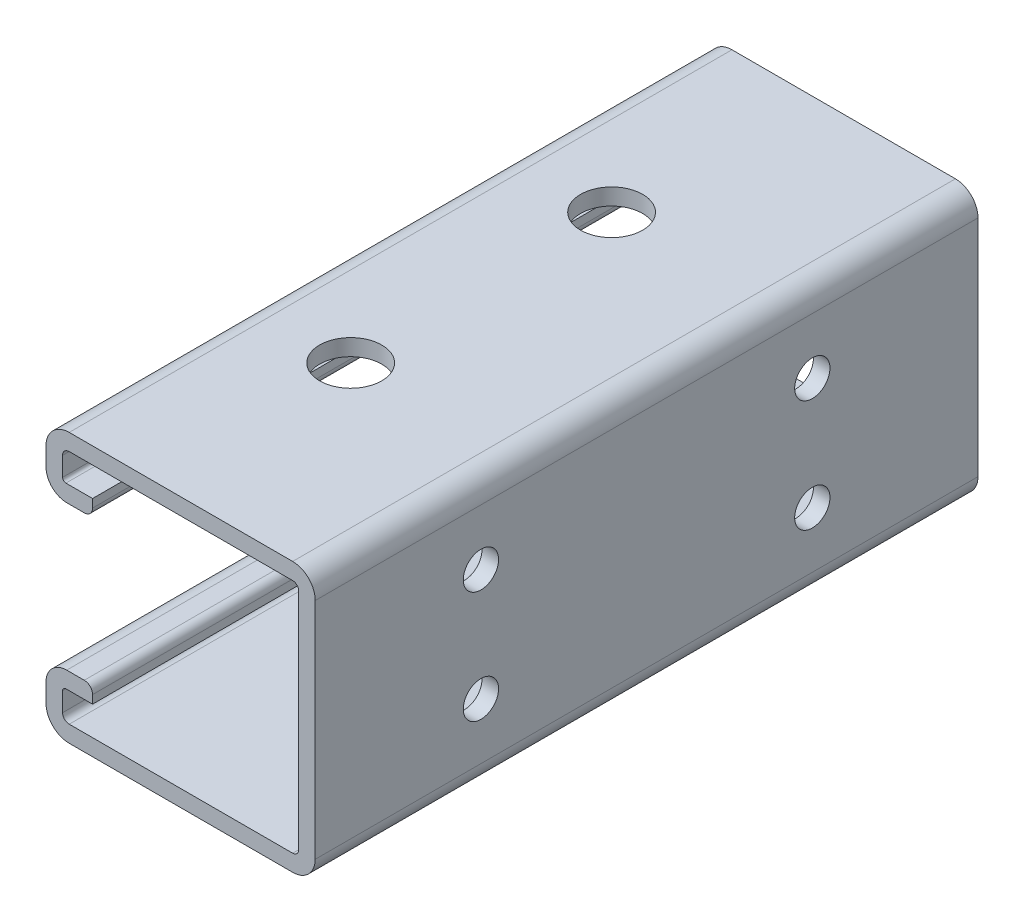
ISO-10303-21;
HEADER;
FILE_DESCRIPTION(('STEP AP214'),'2;1');
FILE_NAME('part.step','',(''),(''),'','','');
FILE_SCHEMA(('AUTOMOTIVE_DESIGN { 1 0 10303 214 1 1 1 1 }'));
ENDSEC;
DATA;
#1=APPLICATION_CONTEXT('core data for automotive mechanical design processes');
#2=APPLICATION_PROTOCOL_DEFINITION('international standard','automotive_design',2000,#1);
#3=PRODUCT_CONTEXT('',#1,'mechanical');
#4=PRODUCT('Part','Part','',(#3));
#5=PRODUCT_RELATED_PRODUCT_CATEGORY('part','',(#4));
#6=PRODUCT_DEFINITION_FORMATION('','',#4);
#7=PRODUCT_DEFINITION_CONTEXT('part definition',#1,'design');
#8=PRODUCT_DEFINITION('design','',#6,#7);
#9=PRODUCT_DEFINITION_SHAPE('','',#8);
#10=(LENGTH_UNIT() NAMED_UNIT(*) SI_UNIT(.MILLI.,.METRE.));
#11=(NAMED_UNIT(*) PLANE_ANGLE_UNIT() SI_UNIT($,.RADIAN.));
#12=(NAMED_UNIT(*) SI_UNIT($,.STERADIAN.) SOLID_ANGLE_UNIT());
#13=UNCERTAINTY_MEASURE_WITH_UNIT(LENGTH_MEASURE(1.E-05),#10,'distance_accuracy_value','');
#14=(GEOMETRIC_REPRESENTATION_CONTEXT(3) GLOBAL_UNCERTAINTY_ASSIGNED_CONTEXT((#13)) GLOBAL_UNIT_ASSIGNED_CONTEXT((#10,
#11,#12)) REPRESENTATION_CONTEXT('',''));
#15=CARTESIAN_POINT('',(0.,0.,0.));
#16=DIRECTION('',(0.,0.,1.));
#17=DIRECTION('',(1.,0.,0.));
#18=AXIS2_PLACEMENT_3D('',#15,#16,#17);
#19=CARTESIAN_POINT('',(18.0975,17.17675,-50.8));
#20=DIRECTION('',(-1.,0.,0.));
#21=DIRECTION('',(0.,0.,1.));
#22=AXIS2_PLACEMENT_3D('',#19,#20,#21);
#23=PLANE('',#22);
#24=CARTESIAN_POINT('',(18.0975,-8.588375,-25.4));
#25=DIRECTION('',(-1.,0.,0.));
#26=DIRECTION('',(0.,0.,1.));
#27=AXIS2_PLACEMENT_3D('',#24,#25,#26);
#28=CIRCLE('',#27,2.70509999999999);
#29=CARTESIAN_POINT('',(18.0975,-8.588375,-22.6949));
#30=VERTEX_POINT('',#29);
#31=EDGE_CURVE('E872',#30,#30,#28,.F.);
#32=ORIENTED_EDGE('',*,*,#31,.T.);
#33=EDGE_LOOP('',(#32));
#34=FACE_BOUND('',#33,.T.);
#35=CARTESIAN_POINT('',(18.0975,-8.588375,25.4));
#36=DIRECTION('',(-1.,0.,0.));
#37=DIRECTION('',(0.,0.,1.));
#38=AXIS2_PLACEMENT_3D('',#35,#36,#37);
#39=CIRCLE('',#38,2.70509999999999);
#40=CARTESIAN_POINT('',(18.0975,-8.588375,28.1051));
#41=VERTEX_POINT('',#40);
#42=EDGE_CURVE('E877',#41,#41,#39,.F.);
#43=ORIENTED_EDGE('',*,*,#42,.T.);
#44=EDGE_LOOP('',(#43));
#45=FACE_BOUND('',#44,.T.);
#46=CARTESIAN_POINT('',(18.0975,8.588375,25.4));
#47=DIRECTION('',(-1.,0.,0.));
#48=DIRECTION('',(0.,0.,1.));
#49=AXIS2_PLACEMENT_3D('',#46,#47,#48);
#50=CIRCLE('',#49,2.70509999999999);
#51=CARTESIAN_POINT('',(18.0975,8.588375,28.1051));
#52=VERTEX_POINT('',#51);
#53=EDGE_CURVE('E595',#52,#52,#50,.F.);
#54=ORIENTED_EDGE('',*,*,#53,.T.);
#55=EDGE_LOOP('',(#54));
#56=FACE_BOUND('',#55,.T.);
#57=DIRECTION('',(0.,0.,1.));
#58=VECTOR('',#57,1.);
#59=CARTESIAN_POINT('',(18.0975,-17.17675,-50.8));
#60=LINE('',#59,#58);
#61=CARTESIAN_POINT('',(18.0975,-17.17675,-50.8));
#62=VERTEX_POINT('',#61);
#63=CARTESIAN_POINT('',(18.0975,-17.17675,50.8));
#64=VERTEX_POINT('',#63);
#65=EDGE_CURVE('E524',#62,#64,#60,.T.);
#66=ORIENTED_EDGE('',*,*,#65,.T.);
#67=DIRECTION('',(0.,-1.,0.));
#68=VECTOR('',#67,1.);
#69=CARTESIAN_POINT('',(18.0975,17.17675,50.8));
#70=LINE('',#69,#68);
#71=CARTESIAN_POINT('',(18.0975,17.17675,50.8));
#72=VERTEX_POINT('',#71);
#73=EDGE_CURVE('E336',#72,#64,#70,.T.);
#74=ORIENTED_EDGE('',*,*,#73,.F.);
#75=DIRECTION('',(0.,0.,1.));
#76=VECTOR('',#75,1.);
#77=CARTESIAN_POINT('',(18.0975,17.17675,-50.8));
#78=LINE('',#77,#76);
#79=CARTESIAN_POINT('',(18.0975,17.17675,-50.8));
#80=VERTEX_POINT('',#79);
#81=EDGE_CURVE('E527',#80,#72,#78,.T.);
#82=ORIENTED_EDGE('',*,*,#81,.F.);
#83=DIRECTION('',(0.,-1.,0.));
#84=VECTOR('',#83,1.);
#85=CARTESIAN_POINT('',(18.0975,17.17675,-50.8));
#86=LINE('',#85,#84);
#87=EDGE_CURVE('E450',#80,#62,#86,.T.);
#88=ORIENTED_EDGE('',*,*,#87,.T.);
#89=EDGE_LOOP('',(#66,#74,#82,#88));
#90=FACE_BOUND('',#89,.T.);
#91=CARTESIAN_POINT('',(18.0975,8.588375,-25.4));
#92=DIRECTION('',(-1.,0.,0.));
#93=DIRECTION('',(0.,0.,1.));
#94=AXIS2_PLACEMENT_3D('',#91,#92,#93);
#95=CIRCLE('',#94,2.70509999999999);
#96=CARTESIAN_POINT('',(18.0975,8.588375,-22.6949));
#97=VERTEX_POINT('',#96);
#98=EDGE_CURVE('E864',#97,#97,#95,.F.);
#99=ORIENTED_EDGE('',*,*,#98,.T.);
#100=EDGE_LOOP('',(#99));
#101=FACE_BOUND('',#100,.T.);
#102=ADVANCED_FACE('F44',(#34,#45,#56,#90,#101),#23,.T.);
#103=CARTESIAN_POINT('',(-17.0815,-17.0815,-50.8));
#104=DIRECTION('',(0.,0.,1.));
#105=DIRECTION('',(1.,0.,0.));
#106=AXIS2_PLACEMENT_3D('',#103,#104,#105);
#107=CYLINDRICAL_SURFACE('',#106,3.556);
#108=DIRECTION('',(0.,0.,1.));
#109=VECTOR('',#108,1.);
#110=CARTESIAN_POINT('',(-17.0815,-20.6375,-50.8));
#111=LINE('',#110,#109);
#112=CARTESIAN_POINT('',(-17.0815,-20.6375,-50.8));
#113=VERTEX_POINT('',#112);
#114=CARTESIAN_POINT('',(-17.0815,-20.6375,50.8));
#115=VERTEX_POINT('',#114);
#116=EDGE_CURVE('E240',#113,#115,#111,.T.);
#117=ORIENTED_EDGE('',*,*,#116,.T.);
#118=CARTESIAN_POINT('',(-17.0815,-17.0815,50.8));
#119=DIRECTION('',(0.,0.,1.));
#120=DIRECTION('',(1.,0.,0.));
#121=AXIS2_PLACEMENT_3D('',#118,#119,#120);
#122=CIRCLE('',#121,3.556);
#123=CARTESIAN_POINT('',(-20.6375,-17.0815,50.8));
#124=VERTEX_POINT('',#123);
#125=EDGE_CURVE('E243',#124,#115,#122,.T.);
#126=ORIENTED_EDGE('',*,*,#125,.F.);
#127=DIRECTION('',(0.,0.,1.));
#128=VECTOR('',#127,1.);
#129=CARTESIAN_POINT('',(-20.6375,-17.0815,-50.8));
#130=LINE('',#129,#128);
#131=CARTESIAN_POINT('',(-20.6375,-17.0815,-50.8));
#132=VERTEX_POINT('',#131);
#133=EDGE_CURVE('E11',#132,#124,#130,.T.);
#134=ORIENTED_EDGE('',*,*,#133,.F.);
#135=CARTESIAN_POINT('',(-17.0815,-17.0815,-50.8));
#136=DIRECTION('',(0.,0.,1.));
#137=DIRECTION('',(1.,0.,0.));
#138=AXIS2_PLACEMENT_3D('',#135,#136,#137);
#139=CIRCLE('',#138,3.556);
#140=EDGE_CURVE('E244',#132,#113,#139,.T.);
#141=ORIENTED_EDGE('',*,*,#140,.T.);
#142=EDGE_LOOP('',(#117,#126,#134,#141));
#143=FACE_BOUND('',#142,.T.);
#144=ADVANCED_FACE('F46',(#143),#107,.T.);
#145=CARTESIAN_POINT('',(-20.6375,-14.2875,-50.8));
#146=DIRECTION('',(-1.,0.,0.));
#147=DIRECTION('',(0.,-1.,0.));
#148=AXIS2_PLACEMENT_3D('',#145,#146,#147);
#149=PLANE('',#148);
#150=ORIENTED_EDGE('',*,*,#133,.T.);
#151=DIRECTION('',(0.,-1.,0.));
#152=VECTOR('',#151,1.);
#153=CARTESIAN_POINT('',(-20.6375,-14.2875,50.8));
#154=LINE('',#153,#152);
#155=CARTESIAN_POINT('',(-20.6375,-14.2875,50.8));
#156=VERTEX_POINT('',#155);
#157=EDGE_CURVE('E264',#156,#124,#154,.T.);
#158=ORIENTED_EDGE('',*,*,#157,.F.);
#159=DIRECTION('',(0.,0.,1.));
#160=VECTOR('',#159,1.);
#161=CARTESIAN_POINT('',(-20.6375,-14.2875,-50.8));
#162=LINE('',#161,#160);
#163=CARTESIAN_POINT('',(-20.6375,-14.2875,-50.8));
#164=VERTEX_POINT('',#163);
#165=EDGE_CURVE('E54',#164,#156,#162,.T.);
#166=ORIENTED_EDGE('',*,*,#165,.F.);
#167=DIRECTION('',(0.,-1.,0.));
#168=VECTOR('',#167,1.);
#169=CARTESIAN_POINT('',(-20.6375,-14.2875,-50.8));
#170=LINE('',#169,#168);
#171=EDGE_CURVE('E250',#164,#132,#170,.T.);
#172=ORIENTED_EDGE('',*,*,#171,.T.);
#173=EDGE_LOOP('',(#150,#158,#166,#172));
#174=FACE_BOUND('',#173,.T.);
#175=ADVANCED_FACE('F635',(#174),#149,.T.);
#176=CARTESIAN_POINT('',(-17.4625,-14.2875,-50.8));
#177=DIRECTION('',(0.,0.,1.));
#178=DIRECTION('',(1.,0.,0.));
#179=AXIS2_PLACEMENT_3D('',#176,#177,#178);
#180=CYLINDRICAL_SURFACE('',#179,3.175);
#181=ORIENTED_EDGE('',*,*,#165,.T.);
#182=CARTESIAN_POINT('',(-17.4625,-14.2875,50.8));
#183=DIRECTION('',(0.,0.,1.));
#184=DIRECTION('',(1.,0.,0.));
#185=AXIS2_PLACEMENT_3D('',#182,#183,#184);
#186=CIRCLE('',#185,3.175);
#187=CARTESIAN_POINT('',(-17.4625,-11.1125,50.8));
#188=VERTEX_POINT('',#187);
#189=EDGE_CURVE('E376',#188,#156,#186,.T.);
#190=ORIENTED_EDGE('',*,*,#189,.F.);
#191=DIRECTION('',(0.,0.,1.));
#192=VECTOR('',#191,1.);
#193=CARTESIAN_POINT('',(-17.4625,-11.1125,-50.8));
#194=LINE('',#193,#192);
#195=CARTESIAN_POINT('',(-17.4625,-11.1125,-50.8));
#196=VERTEX_POINT('',#195);
#197=EDGE_CURVE('E497',#196,#188,#194,.T.);
#198=ORIENTED_EDGE('',*,*,#197,.F.);
#199=CARTESIAN_POINT('',(-17.4625,-14.2875,-50.8));
#200=DIRECTION('',(0.,0.,1.));
#201=DIRECTION('',(1.,0.,0.));
#202=AXIS2_PLACEMENT_3D('',#199,#200,#201);
#203=CIRCLE('',#202,3.175);
#204=EDGE_CURVE('E490',#196,#164,#203,.T.);
#205=ORIENTED_EDGE('',*,*,#204,.T.);
#206=EDGE_LOOP('',(#181,#190,#198,#205));
#207=FACE_BOUND('',#206,.T.);
#208=ADVANCED_FACE('F792',(#207),#180,.T.);
#209=CARTESIAN_POINT('',(-14.7701,-11.1125,-50.8));
#210=DIRECTION('',(0.,1.,0.));
#211=DIRECTION('',(0.,0.,1.));
#212=AXIS2_PLACEMENT_3D('',#209,#210,#211);
#213=PLANE('',#212);
#214=ORIENTED_EDGE('',*,*,#197,.T.);
#215=DIRECTION('',(-1.,0.,0.));
#216=VECTOR('',#215,1.);
#217=CARTESIAN_POINT('',(-14.7701,-11.1125,50.8));
#218=LINE('',#217,#216);
#219=CARTESIAN_POINT('',(-14.7701,-11.1125,50.8));
#220=VERTEX_POINT('',#219);
#221=EDGE_CURVE('E372',#220,#188,#218,.T.);
#222=ORIENTED_EDGE('',*,*,#221,.F.);
#223=DIRECTION('',(0.,0.,1.));
#224=VECTOR('',#223,1.);
#225=CARTESIAN_POINT('',(-14.7701,-11.1125,-50.8));
#226=LINE('',#225,#224);
#227=CARTESIAN_POINT('',(-14.7701,-11.1125,-50.8));
#228=VERTEX_POINT('',#227);
#229=EDGE_CURVE('E500',#228,#220,#226,.T.);
#230=ORIENTED_EDGE('',*,*,#229,.F.);
#231=DIRECTION('',(-1.,0.,0.));
#232=VECTOR('',#231,1.);
#233=CARTESIAN_POINT('',(-14.7701,-11.1125,-50.8));
#234=LINE('',#233,#232);
#235=EDGE_CURVE('E486',#228,#196,#234,.T.);
#236=ORIENTED_EDGE('',*,*,#235,.T.);
#237=EDGE_LOOP('',(#214,#222,#230,#236));
#238=FACE_BOUND('',#237,.T.);
#239=ADVANCED_FACE('F788',(#238),#213,.T.);
#240=CARTESIAN_POINT('',(-14.7701,-12.3825,-50.8));
#241=DIRECTION('',(0.,0.,1.));
#242=DIRECTION('',(1.,0.,0.));
#243=AXIS2_PLACEMENT_3D('',#240,#241,#242);
#244=CYLINDRICAL_SURFACE('',#243,1.27);
#245=ORIENTED_EDGE('',*,*,#229,.T.);
#246=CARTESIAN_POINT('',(-14.7701,-12.3825,50.8));
#247=DIRECTION('',(0.,0.,1.));
#248=DIRECTION('',(1.,0.,0.));
#249=AXIS2_PLACEMENT_3D('',#246,#247,#248);
#250=CIRCLE('',#249,1.27);
#251=CARTESIAN_POINT('',(-13.5001,-12.3825,50.8));
#252=VERTEX_POINT('',#251);
#253=EDGE_CURVE('E368',#252,#220,#250,.T.);
#254=ORIENTED_EDGE('',*,*,#253,.F.);
#255=DIRECTION('',(0.,0.,1.));
#256=VECTOR('',#255,1.);
#257=CARTESIAN_POINT('',(-13.5001,-12.3825,-50.8));
#258=LINE('',#257,#256);
#259=CARTESIAN_POINT('',(-13.5001,-12.3825,-50.8));
#260=VERTEX_POINT('',#259);
#261=EDGE_CURVE('E503',#260,#252,#258,.T.);
#262=ORIENTED_EDGE('',*,*,#261,.F.);
#263=CARTESIAN_POINT('',(-14.7701,-12.3825,-50.8));
#264=DIRECTION('',(0.,0.,1.));
#265=DIRECTION('',(1.,0.,0.));
#266=AXIS2_PLACEMENT_3D('',#263,#264,#265);
#267=CIRCLE('',#266,1.27);
#268=EDGE_CURVE('E482',#260,#228,#267,.T.);
#269=ORIENTED_EDGE('',*,*,#268,.T.);
#270=EDGE_LOOP('',(#245,#254,#262,#269));
#271=FACE_BOUND('',#270,.T.);
#272=ADVANCED_FACE('F783',(#271),#244,.T.);
#273=CARTESIAN_POINT('',(-13.5001,-13.6525,-50.8));
#274=DIRECTION('',(1.,0.,0.));
#275=DIRECTION('',(0.,0.,-1.));
#276=AXIS2_PLACEMENT_3D('',#273,#274,#275);
#277=PLANE('',#276);
#278=ORIENTED_EDGE('',*,*,#261,.T.);
#279=DIRECTION('',(0.,1.,0.));
#280=VECTOR('',#279,1.);
#281=CARTESIAN_POINT('',(-13.5001,-13.6525,50.8));
#282=LINE('',#281,#280);
#283=CARTESIAN_POINT('',(-13.5001,-13.6525,50.8));
#284=VERTEX_POINT('',#283);
#285=EDGE_CURVE('E364',#284,#252,#282,.T.);
#286=ORIENTED_EDGE('',*,*,#285,.F.);
#287=DIRECTION('',(0.,0.,1.));
#288=VECTOR('',#287,1.);
#289=CARTESIAN_POINT('',(-13.5001,-13.6525,-50.8));
#290=LINE('',#289,#288);
#291=CARTESIAN_POINT('',(-13.5001,-13.6525,-50.8));
#292=VERTEX_POINT('',#291);
#293=EDGE_CURVE('E506',#292,#284,#290,.T.);
#294=ORIENTED_EDGE('',*,*,#293,.F.);
#295=DIRECTION('',(0.,1.,0.));
#296=VECTOR('',#295,1.);
#297=CARTESIAN_POINT('',(-13.5001,-13.6525,-50.8));
#298=LINE('',#297,#296);
#299=EDGE_CURVE('E478',#292,#260,#298,.T.);
#300=ORIENTED_EDGE('',*,*,#299,.T.);
#301=EDGE_LOOP('',(#278,#286,#294,#300));
#302=FACE_BOUND('',#301,.T.);
#303=ADVANCED_FACE('F781',(#302),#277,.T.);
#304=CARTESIAN_POINT('',(-17.5895,-13.6525,-50.8));
#305=DIRECTION('',(0.,-1.,0.));
#306=DIRECTION('',(1.,0.,0.));
#307=AXIS2_PLACEMENT_3D('',#304,#305,#306);
#308=PLANE('',#307);
#309=ORIENTED_EDGE('',*,*,#293,.T.);
#310=DIRECTION('',(1.,0.,0.));
#311=VECTOR('',#310,1.);
#312=CARTESIAN_POINT('',(-17.5895,-13.6525,50.8));
#313=LINE('',#312,#311);
#314=CARTESIAN_POINT('',(-17.5895,-13.6525,50.8));
#315=VERTEX_POINT('',#314);
#316=EDGE_CURVE('E360',#315,#284,#313,.T.);
#317=ORIENTED_EDGE('',*,*,#316,.F.);
#318=DIRECTION('',(0.,0.,1.));
#319=VECTOR('',#318,1.);
#320=CARTESIAN_POINT('',(-17.5895,-13.6525,-50.8));
#321=LINE('',#320,#319);
#322=CARTESIAN_POINT('',(-17.5895,-13.6525,-50.8));
#323=VERTEX_POINT('',#322);
#324=EDGE_CURVE('E509',#323,#315,#321,.T.);
#325=ORIENTED_EDGE('',*,*,#324,.F.);
#326=DIRECTION('',(1.,0.,0.));
#327=VECTOR('',#326,1.);
#328=CARTESIAN_POINT('',(-17.5895,-13.6525,-50.8));
#329=LINE('',#328,#327);
#330=EDGE_CURVE('E474',#323,#292,#329,.T.);
#331=ORIENTED_EDGE('',*,*,#330,.T.);
#332=EDGE_LOOP('',(#309,#317,#325,#331));
#333=FACE_BOUND('',#332,.T.);
#334=ADVANCED_FACE('F776',(#333),#308,.T.);
#335=CARTESIAN_POINT('',(-17.5895,-14.1605,-50.8));
#336=DIRECTION('',(0.,0.,1.));
#337=DIRECTION('',(1.,0.,0.));
#338=AXIS2_PLACEMENT_3D('',#335,#336,#337);
#339=CYLINDRICAL_SURFACE('',#338,0.507999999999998);
#340=ORIENTED_EDGE('',*,*,#324,.T.);
#341=CARTESIAN_POINT('',(-17.5895,-14.1605,50.8));
#342=DIRECTION('',(0.,0.,-1.));
#343=DIRECTION('',(1.,0.,0.));
#344=AXIS2_PLACEMENT_3D('',#341,#342,#343);
#345=CIRCLE('',#344,0.507999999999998);
#346=CARTESIAN_POINT('',(-18.0975,-14.1605,50.8));
#347=VERTEX_POINT('',#346);
#348=EDGE_CURVE('E356',#347,#315,#345,.T.);
#349=ORIENTED_EDGE('',*,*,#348,.F.);
#350=DIRECTION('',(0.,0.,1.));
#351=VECTOR('',#350,1.);
#352=CARTESIAN_POINT('',(-18.0975,-14.1605,-50.8));
#353=LINE('',#352,#351);
#354=CARTESIAN_POINT('',(-18.0975,-14.1605,-50.8));
#355=VERTEX_POINT('',#354);
#356=EDGE_CURVE('E512',#355,#347,#353,.T.);
#357=ORIENTED_EDGE('',*,*,#356,.F.);
#358=CARTESIAN_POINT('',(-17.5895,-14.1605,-50.8));
#359=DIRECTION('',(0.,0.,-1.));
#360=DIRECTION('',(1.,0.,0.));
#361=AXIS2_PLACEMENT_3D('',#358,#359,#360);
#362=CIRCLE('',#361,0.507999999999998);
#363=EDGE_CURVE('E470',#355,#323,#362,.T.);
#364=ORIENTED_EDGE('',*,*,#363,.T.);
#365=EDGE_LOOP('',(#340,#349,#357,#364));
#366=FACE_BOUND('',#365,.T.);
#367=ADVANCED_FACE('F771',(#366),#339,.F.);
#368=CARTESIAN_POINT('',(-18.0975,-17.0815,-50.8));
#369=DIRECTION('',(1.,0.,0.));
#370=DIRECTION('',(0.,1.,0.));
#371=AXIS2_PLACEMENT_3D('',#368,#369,#370);
#372=PLANE('',#371);
#373=ORIENTED_EDGE('',*,*,#356,.T.);
#374=DIRECTION('',(0.,1.,0.));
#375=VECTOR('',#374,1.);
#376=CARTESIAN_POINT('',(-18.0975,-17.0815,50.8));
#377=LINE('',#376,#375);
#378=CARTESIAN_POINT('',(-18.0975,-17.0815,50.8));
#379=VERTEX_POINT('',#378);
#380=EDGE_CURVE('E352',#379,#347,#377,.T.);
#381=ORIENTED_EDGE('',*,*,#380,.F.);
#382=DIRECTION('',(0.,0.,1.));
#383=VECTOR('',#382,1.);
#384=CARTESIAN_POINT('',(-18.0975,-17.0815,-50.8));
#385=LINE('',#384,#383);
#386=CARTESIAN_POINT('',(-18.0975,-17.0815,-50.8));
#387=VERTEX_POINT('',#386);
#388=EDGE_CURVE('E515',#387,#379,#385,.T.);
#389=ORIENTED_EDGE('',*,*,#388,.F.);
#390=DIRECTION('',(0.,1.,0.));
#391=VECTOR('',#390,1.);
#392=CARTESIAN_POINT('',(-18.0975,-17.0815,-50.8));
#393=LINE('',#392,#391);
#394=EDGE_CURVE('E466',#387,#355,#393,.T.);
#395=ORIENTED_EDGE('',*,*,#394,.T.);
#396=EDGE_LOOP('',(#373,#381,#389,#395));
#397=FACE_BOUND('',#396,.T.);
#398=ADVANCED_FACE('F769',(#397),#372,.T.);
#399=CARTESIAN_POINT('',(-17.0815,-17.0815,-50.8));
#400=DIRECTION('',(0.,0.,1.));
#401=DIRECTION('',(1.,0.,0.));
#402=AXIS2_PLACEMENT_3D('',#399,#400,#401);
#403=CYLINDRICAL_SURFACE('',#402,1.016);
#404=ORIENTED_EDGE('',*,*,#388,.T.);
#405=CARTESIAN_POINT('',(-17.0815,-17.0815,50.8));
#406=DIRECTION('',(0.,0.,-1.));
#407=DIRECTION('',(1.,0.,0.));
#408=AXIS2_PLACEMENT_3D('',#405,#406,#407);
#409=CIRCLE('',#408,1.016);
#410=CARTESIAN_POINT('',(-17.0815,-18.0975,50.8));
#411=VERTEX_POINT('',#410);
#412=EDGE_CURVE('E348',#411,#379,#409,.T.);
#413=ORIENTED_EDGE('',*,*,#412,.F.);
#414=DIRECTION('',(0.,0.,1.));
#415=VECTOR('',#414,1.);
#416=CARTESIAN_POINT('',(-17.0815,-18.0975,-50.8));
#417=LINE('',#416,#415);
#418=CARTESIAN_POINT('',(-17.0815,-18.0975,-50.8));
#419=VERTEX_POINT('',#418);
#420=EDGE_CURVE('E518',#419,#411,#417,.T.);
#421=ORIENTED_EDGE('',*,*,#420,.F.);
#422=CARTESIAN_POINT('',(-17.0815,-17.0815,-50.8));
#423=DIRECTION('',(0.,0.,-1.));
#424=DIRECTION('',(1.,0.,0.));
#425=AXIS2_PLACEMENT_3D('',#422,#423,#424);
#426=CIRCLE('',#425,1.016);
#427=EDGE_CURVE('E462',#419,#387,#426,.T.);
#428=ORIENTED_EDGE('',*,*,#427,.T.);
#429=EDGE_LOOP('',(#404,#413,#421,#428));
#430=FACE_BOUND('',#429,.T.);
#431=ADVANCED_FACE('F764',(#430),#403,.F.);
#432=CARTESIAN_POINT('',(17.17675,-18.0975,-50.8));
#433=DIRECTION('',(0.,1.,0.));
#434=DIRECTION('',(-1.,0.,0.));
#435=AXIS2_PLACEMENT_3D('',#432,#433,#434);
#436=PLANE('',#435);
#437=CARTESIAN_POINT('',(-4.73074999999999,-18.0975,20.));
#438=DIRECTION('',(0.,1.,0.));
#439=DIRECTION('',(-1.,0.,0.));
#440=AXIS2_PLACEMENT_3D('',#437,#438,#439);
#441=CIRCLE('',#440,4.7625);
#442=CARTESIAN_POINT('',(-9.49324999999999,-18.0975,20.));
#443=VERTEX_POINT('',#442);
#444=EDGE_CURVE('E266',#443,#443,#441,.T.);
#445=ORIENTED_EDGE('',*,*,#444,.F.);
#446=EDGE_LOOP('',(#445));
#447=FACE_BOUND('',#446,.T.);
#448=CARTESIAN_POINT('',(-4.73075,-18.0975,-20.));
#449=DIRECTION('',(0.,1.,0.));
#450=DIRECTION('',(-1.,0.,0.));
#451=AXIS2_PLACEMENT_3D('',#448,#449,#450);
#452=CIRCLE('',#451,4.7625);
#453=CARTESIAN_POINT('',(-9.49325,-18.0975,-20.));
#454=VERTEX_POINT('',#453);
#455=EDGE_CURVE('E586',#454,#454,#452,.T.);
#456=ORIENTED_EDGE('',*,*,#455,.F.);
#457=EDGE_LOOP('',(#456));
#458=FACE_BOUND('',#457,.T.);
#459=ORIENTED_EDGE('',*,*,#420,.T.);
#460=DIRECTION('',(-1.,0.,0.));
#461=VECTOR('',#460,1.);
#462=CARTESIAN_POINT('',(17.17675,-18.0975,50.8));
#463=LINE('',#462,#461);
#464=CARTESIAN_POINT('',(17.17675,-18.0975,50.8));
#465=VERTEX_POINT('',#464);
#466=EDGE_CURVE('E344',#465,#411,#463,.T.);
#467=ORIENTED_EDGE('',*,*,#466,.F.);
#468=DIRECTION('',(0.,0.,1.));
#469=VECTOR('',#468,1.);
#470=CARTESIAN_POINT('',(17.17675,-18.0975,-50.8));
#471=LINE('',#470,#469);
#472=CARTESIAN_POINT('',(17.17675,-18.0975,-50.8));
#473=VERTEX_POINT('',#472);
#474=EDGE_CURVE('E521',#473,#465,#471,.T.);
#475=ORIENTED_EDGE('',*,*,#474,.F.);
#476=DIRECTION('',(-1.,0.,0.));
#477=VECTOR('',#476,1.);
#478=CARTESIAN_POINT('',(17.17675,-18.0975,-50.8));
#479=LINE('',#478,#477);
#480=EDGE_CURVE('E458',#473,#419,#479,.T.);
#481=ORIENTED_EDGE('',*,*,#480,.T.);
#482=EDGE_LOOP('',(#459,#467,#475,#481));
#483=FACE_BOUND('',#482,.T.);
#484=ADVANCED_FACE('F759',(#447,#458,#483),#436,.T.);
#485=CARTESIAN_POINT('',(17.17675,-17.17675,-50.8));
#486=DIRECTION('',(0.,0.,1.));
#487=DIRECTION('',(1.,0.,0.));
#488=AXIS2_PLACEMENT_3D('',#485,#486,#487);
#489=CYLINDRICAL_SURFACE('',#488,0.920750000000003);
#490=ORIENTED_EDGE('',*,*,#474,.T.);
#491=CARTESIAN_POINT('',(17.17675,-17.17675,50.8));
#492=DIRECTION('',(0.,0.,-1.));
#493=DIRECTION('',(1.,0.,0.));
#494=AXIS2_PLACEMENT_3D('',#491,#492,#493);
#495=CIRCLE('',#494,0.920750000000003);
#496=EDGE_CURVE('E340',#64,#465,#495,.T.);
#497=ORIENTED_EDGE('',*,*,#496,.F.);
#498=ORIENTED_EDGE('',*,*,#65,.F.);
#499=CARTESIAN_POINT('',(17.17675,-17.17675,-50.8));
#500=DIRECTION('',(0.,0.,-1.));
#501=DIRECTION('',(1.,0.,0.));
#502=AXIS2_PLACEMENT_3D('',#499,#500,#501);
#503=CIRCLE('',#502,0.920750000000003);
#504=EDGE_CURVE('E454',#62,#473,#503,.T.);
#505=ORIENTED_EDGE('',*,*,#504,.T.);
#506=EDGE_LOOP('',(#490,#497,#498,#505));
#507=FACE_BOUND('',#506,.T.);
#508=ADVANCED_FACE('F640',(#507),#489,.F.);
#509=CARTESIAN_POINT('',(17.17675,17.17675,-50.8));
#510=DIRECTION('',(0.,0.,1.));
#511=DIRECTION('',(1.,0.,0.));
#512=AXIS2_PLACEMENT_3D('',#509,#510,#511);
#513=CYLINDRICAL_SURFACE('',#512,0.920750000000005);
#514=ORIENTED_EDGE('',*,*,#81,.T.);
#515=CARTESIAN_POINT('',(17.17675,17.17675,50.8));
#516=DIRECTION('',(0.,0.,-1.));
#517=DIRECTION('',(1.,0.,0.));
#518=AXIS2_PLACEMENT_3D('',#515,#516,#517);
#519=CIRCLE('',#518,0.920750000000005);
#520=CARTESIAN_POINT('',(17.17675,18.0975,50.8));
#521=VERTEX_POINT('',#520);
#522=EDGE_CURVE('E332',#521,#72,#519,.T.);
#523=ORIENTED_EDGE('',*,*,#522,.F.);
#524=DIRECTION('',(0.,0.,1.));
#525=VECTOR('',#524,1.);
#526=CARTESIAN_POINT('',(17.17675,18.0975,-50.8));
#527=LINE('',#526,#525);
#528=CARTESIAN_POINT('',(17.17675,18.0975,-50.8));
#529=VERTEX_POINT('',#528);
#530=EDGE_CURVE('E530',#529,#521,#527,.T.);
#531=ORIENTED_EDGE('',*,*,#530,.F.);
#532=CARTESIAN_POINT('',(17.17675,17.17675,-50.8));
#533=DIRECTION('',(0.,0.,-1.));
#534=DIRECTION('',(1.,0.,0.));
#535=AXIS2_PLACEMENT_3D('',#532,#533,#534);
#536=CIRCLE('',#535,0.920750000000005);
#537=EDGE_CURVE('E446',#529,#80,#536,.T.);
#538=ORIENTED_EDGE('',*,*,#537,.T.);
#539=EDGE_LOOP('',(#514,#523,#531,#538));
#540=FACE_BOUND('',#539,.T.);
#541=ADVANCED_FACE('F642',(#540),#513,.F.);
#542=CARTESIAN_POINT('',(-17.0815,18.0975,-50.8));
#543=DIRECTION('',(0.,-1.,0.));
#544=DIRECTION('',(1.,0.,0.));
#545=AXIS2_PLACEMENT_3D('',#542,#543,#544);
#546=PLANE('',#545);
#547=CARTESIAN_POINT('',(-4.73075,18.0975,20.));
#548=DIRECTION('',(0.,-1.,0.));
#549=DIRECTION('',(1.,0.,0.));
#550=AXIS2_PLACEMENT_3D('',#547,#548,#549);
#551=CIRCLE('',#550,4.7625);
#552=CARTESIAN_POINT('',(0.0317500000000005,18.0975,20.));
#553=VERTEX_POINT('',#552);
#554=EDGE_CURVE('E270',#553,#553,#551,.T.);
#555=ORIENTED_EDGE('',*,*,#554,.F.);
#556=EDGE_LOOP('',(#555));
#557=FACE_BOUND('',#556,.T.);
#558=CARTESIAN_POINT('',(-4.73075,18.0975,-20.));
#559=DIRECTION('',(0.,-1.,0.));
#560=DIRECTION('',(1.,0.,0.));
#561=AXIS2_PLACEMENT_3D('',#558,#559,#560);
#562=CIRCLE('',#561,4.7625);
#563=CARTESIAN_POINT('',(0.0317499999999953,18.0975,-20.));
#564=VERTEX_POINT('',#563);
#565=EDGE_CURVE('E579',#564,#564,#562,.T.);
#566=ORIENTED_EDGE('',*,*,#565,.F.);
#567=EDGE_LOOP('',(#566));
#568=FACE_BOUND('',#567,.T.);
#569=ORIENTED_EDGE('',*,*,#530,.T.);
#570=DIRECTION('',(1.,0.,0.));
#571=VECTOR('',#570,1.);
#572=CARTESIAN_POINT('',(-17.0815,18.0975,50.8));
#573=LINE('',#572,#571);
#574=CARTESIAN_POINT('',(-17.0815,18.0975,50.8));
#575=VERTEX_POINT('',#574);
#576=EDGE_CURVE('E328',#575,#521,#573,.T.);
#577=ORIENTED_EDGE('',*,*,#576,.F.);
#578=DIRECTION('',(0.,0.,1.));
#579=VECTOR('',#578,1.);
#580=CARTESIAN_POINT('',(-17.0815,18.0975,-50.8));
#581=LINE('',#580,#579);
#582=CARTESIAN_POINT('',(-17.0815,18.0975,-50.8));
#583=VERTEX_POINT('',#582);
#584=EDGE_CURVE('E533',#583,#575,#581,.T.);
#585=ORIENTED_EDGE('',*,*,#584,.F.);
#586=DIRECTION('',(1.,0.,0.));
#587=VECTOR('',#586,1.);
#588=CARTESIAN_POINT('',(-17.0815,18.0975,-50.8));
#589=LINE('',#588,#587);
#590=EDGE_CURVE('E442',#583,#529,#589,.T.);
#591=ORIENTED_EDGE('',*,*,#590,.T.);
#592=EDGE_LOOP('',(#569,#577,#585,#591));
#593=FACE_BOUND('',#592,.T.);
#594=ADVANCED_FACE('F645',(#557,#568,#593),#546,.T.);
#595=CARTESIAN_POINT('',(-17.0815,17.0815,-50.8));
#596=DIRECTION('',(0.,0.,1.));
#597=DIRECTION('',(1.,0.,0.));
#598=AXIS2_PLACEMENT_3D('',#595,#596,#597);
#599=CYLINDRICAL_SURFACE('',#598,1.016);
#600=ORIENTED_EDGE('',*,*,#584,.T.);
#601=CARTESIAN_POINT('',(-17.0815,17.0815,50.8));
#602=DIRECTION('',(0.,0.,-1.));
#603=DIRECTION('',(1.,0.,0.));
#604=AXIS2_PLACEMENT_3D('',#601,#602,#603);
#605=CIRCLE('',#604,1.016);
#606=CARTESIAN_POINT('',(-18.0975,17.0815,50.8));
#607=VERTEX_POINT('',#606);
#608=EDGE_CURVE('E324',#607,#575,#605,.T.);
#609=ORIENTED_EDGE('',*,*,#608,.F.);
#610=DIRECTION('',(0.,0.,1.));
#611=VECTOR('',#610,1.);
#612=CARTESIAN_POINT('',(-18.0975,17.0815,-50.8));
#613=LINE('',#612,#611);
#614=CARTESIAN_POINT('',(-18.0975,17.0815,-50.8));
#615=VERTEX_POINT('',#614);
#616=EDGE_CURVE('E536',#615,#607,#613,.T.);
#617=ORIENTED_EDGE('',*,*,#616,.F.);
#618=CARTESIAN_POINT('',(-17.0815,17.0815,-50.8));
#619=DIRECTION('',(0.,0.,-1.));
#620=DIRECTION('',(1.,0.,0.));
#621=AXIS2_PLACEMENT_3D('',#618,#619,#620);
#622=CIRCLE('',#621,1.016);
#623=EDGE_CURVE('E438',#615,#583,#622,.T.);
#624=ORIENTED_EDGE('',*,*,#623,.T.);
#625=EDGE_LOOP('',(#600,#609,#617,#624));
#626=FACE_BOUND('',#625,.T.);
#627=ADVANCED_FACE('F649',(#626),#599,.F.);
#628=CARTESIAN_POINT('',(-18.0975,14.1605,-50.8));
#629=DIRECTION('',(1.,0.,0.));
#630=DIRECTION('',(0.,1.,0.));
#631=AXIS2_PLACEMENT_3D('',#628,#629,#630);
#632=PLANE('',#631);
#633=ORIENTED_EDGE('',*,*,#616,.T.);
#634=DIRECTION('',(0.,1.,0.));
#635=VECTOR('',#634,1.);
#636=CARTESIAN_POINT('',(-18.0975,14.1605,50.8));
#637=LINE('',#636,#635);
#638=CARTESIAN_POINT('',(-18.0975,14.1605,50.8));
#639=VERTEX_POINT('',#638);
#640=EDGE_CURVE('E320',#639,#607,#637,.T.);
#641=ORIENTED_EDGE('',*,*,#640,.F.);
#642=DIRECTION('',(0.,0.,1.));
#643=VECTOR('',#642,1.);
#644=CARTESIAN_POINT('',(-18.0975,14.1605,-50.8));
#645=LINE('',#644,#643);
#646=CARTESIAN_POINT('',(-18.0975,14.1605,-50.8));
#647=VERTEX_POINT('',#646);
#648=EDGE_CURVE('E539',#647,#639,#645,.T.);
#649=ORIENTED_EDGE('',*,*,#648,.F.);
#650=DIRECTION('',(0.,1.,0.));
#651=VECTOR('',#650,1.);
#652=CARTESIAN_POINT('',(-18.0975,14.1605,-50.8));
#653=LINE('',#652,#651);
#654=EDGE_CURVE('E434',#647,#615,#653,.T.);
#655=ORIENTED_EDGE('',*,*,#654,.T.);
#656=EDGE_LOOP('',(#633,#641,#649,#655));
#657=FACE_BOUND('',#656,.T.);
#658=ADVANCED_FACE('F653',(#657),#632,.T.);
#659=CARTESIAN_POINT('',(-17.5895,14.1605,-50.8));
#660=DIRECTION('',(0.,0.,1.));
#661=DIRECTION('',(1.,0.,0.));
#662=AXIS2_PLACEMENT_3D('',#659,#660,#661);
#663=CYLINDRICAL_SURFACE('',#662,0.507999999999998);
#664=ORIENTED_EDGE('',*,*,#648,.T.);
#665=CARTESIAN_POINT('',(-17.5895,14.1605,50.8));
#666=DIRECTION('',(0.,0.,-1.));
#667=DIRECTION('',(1.,0.,0.));
#668=AXIS2_PLACEMENT_3D('',#665,#666,#667);
#669=CIRCLE('',#668,0.507999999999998);
#670=CARTESIAN_POINT('',(-17.5895,13.6525,50.8));
#671=VERTEX_POINT('',#670);
#672=EDGE_CURVE('E316',#671,#639,#669,.T.);
#673=ORIENTED_EDGE('',*,*,#672,.F.);
#674=DIRECTION('',(0.,0.,1.));
#675=VECTOR('',#674,1.);
#676=CARTESIAN_POINT('',(-17.5895,13.6525,-50.8));
#677=LINE('',#676,#675);
#678=CARTESIAN_POINT('',(-17.5895,13.6525,-50.8));
#679=VERTEX_POINT('',#678);
#680=EDGE_CURVE('E542',#679,#671,#677,.T.);
#681=ORIENTED_EDGE('',*,*,#680,.F.);
#682=CARTESIAN_POINT('',(-17.5895,14.1605,-50.8));
#683=DIRECTION('',(0.,0.,-1.));
#684=DIRECTION('',(1.,0.,0.));
#685=AXIS2_PLACEMENT_3D('',#682,#683,#684);
#686=CIRCLE('',#685,0.507999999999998);
#687=EDGE_CURVE('E430',#679,#647,#686,.T.);
#688=ORIENTED_EDGE('',*,*,#687,.T.);
#689=EDGE_LOOP('',(#664,#673,#681,#688));
#690=FACE_BOUND('',#689,.T.);
#691=ADVANCED_FACE('F657',(#690),#663,.F.);
#692=CARTESIAN_POINT('',(-13.5001,13.6525,-50.8));
#693=DIRECTION('',(0.,1.,0.));
#694=DIRECTION('',(-1.,0.,0.));
#695=AXIS2_PLACEMENT_3D('',#692,#693,#694);
#696=PLANE('',#695);
#697=ORIENTED_EDGE('',*,*,#680,.T.);
#698=DIRECTION('',(-1.,0.,0.));
#699=VECTOR('',#698,1.);
#700=CARTESIAN_POINT('',(-13.5001,13.6525,50.8));
#701=LINE('',#700,#699);
#702=CARTESIAN_POINT('',(-13.5001,13.6525,50.8));
#703=VERTEX_POINT('',#702);
#704=EDGE_CURVE('E312',#703,#671,#701,.T.);
#705=ORIENTED_EDGE('',*,*,#704,.F.);
#706=DIRECTION('',(0.,0.,1.));
#707=VECTOR('',#706,1.);
#708=CARTESIAN_POINT('',(-13.5001,13.6525,-50.8));
#709=LINE('',#708,#707);
#710=CARTESIAN_POINT('',(-13.5001,13.6525,-50.8));
#711=VERTEX_POINT('',#710);
#712=EDGE_CURVE('E545',#711,#703,#709,.T.);
#713=ORIENTED_EDGE('',*,*,#712,.F.);
#714=DIRECTION('',(-1.,0.,0.));
#715=VECTOR('',#714,1.);
#716=CARTESIAN_POINT('',(-13.5001,13.6525,-50.8));
#717=LINE('',#716,#715);
#718=EDGE_CURVE('E426',#711,#679,#717,.T.);
#719=ORIENTED_EDGE('',*,*,#718,.T.);
#720=EDGE_LOOP('',(#697,#705,#713,#719));
#721=FACE_BOUND('',#720,.T.);
#722=ADVANCED_FACE('F661',(#721),#696,.T.);
#723=CARTESIAN_POINT('',(-13.5001,12.3825,-50.8));
#724=DIRECTION('',(1.,0.,0.));
#725=DIRECTION('',(0.,0.,-1.));
#726=AXIS2_PLACEMENT_3D('',#723,#724,#725);
#727=PLANE('',#726);
#728=ORIENTED_EDGE('',*,*,#712,.T.);
#729=DIRECTION('',(0.,1.,0.));
#730=VECTOR('',#729,1.);
#731=CARTESIAN_POINT('',(-13.5001,12.3825,50.8));
#732=LINE('',#731,#730);
#733=CARTESIAN_POINT('',(-13.5001,12.3825,50.8));
#734=VERTEX_POINT('',#733);
#735=EDGE_CURVE('E308',#734,#703,#732,.T.);
#736=ORIENTED_EDGE('',*,*,#735,.F.);
#737=DIRECTION('',(0.,0.,1.));
#738=VECTOR('',#737,1.);
#739=CARTESIAN_POINT('',(-13.5001,12.3825,-50.8));
#740=LINE('',#739,#738);
#741=CARTESIAN_POINT('',(-13.5001,12.3825,-50.8));
#742=VERTEX_POINT('',#741);
#743=EDGE_CURVE('E548',#742,#734,#740,.T.);
#744=ORIENTED_EDGE('',*,*,#743,.F.);
#745=DIRECTION('',(0.,1.,0.));
#746=VECTOR('',#745,1.);
#747=CARTESIAN_POINT('',(-13.5001,12.3825,-50.8));
#748=LINE('',#747,#746);
#749=EDGE_CURVE('E422',#742,#711,#748,.T.);
#750=ORIENTED_EDGE('',*,*,#749,.T.);
#751=EDGE_LOOP('',(#728,#736,#744,#750));
#752=FACE_BOUND('',#751,.T.);
#753=ADVANCED_FACE('F665',(#752),#727,.T.);
#754=CARTESIAN_POINT('',(-14.7701,12.3825,-50.8));
#755=DIRECTION('',(0.,0.,1.));
#756=DIRECTION('',(1.,0.,0.));
#757=AXIS2_PLACEMENT_3D('',#754,#755,#756);
#758=CYLINDRICAL_SURFACE('',#757,1.27);
#759=ORIENTED_EDGE('',*,*,#743,.T.);
#760=CARTESIAN_POINT('',(-14.7701,12.3825,50.8));
#761=DIRECTION('',(0.,0.,1.));
#762=DIRECTION('',(1.,0.,0.));
#763=AXIS2_PLACEMENT_3D('',#760,#761,#762);
#764=CIRCLE('',#763,1.27);
#765=CARTESIAN_POINT('',(-14.7701,11.1125,50.8));
#766=VERTEX_POINT('',#765);
#767=EDGE_CURVE('E304',#766,#734,#764,.T.);
#768=ORIENTED_EDGE('',*,*,#767,.F.);
#769=DIRECTION('',(0.,0.,1.));
#770=VECTOR('',#769,1.);
#771=CARTESIAN_POINT('',(-14.7701,11.1125,-50.8));
#772=LINE('',#771,#770);
#773=CARTESIAN_POINT('',(-14.7701,11.1125,-50.8));
#774=VERTEX_POINT('',#773);
#775=EDGE_CURVE('E551',#774,#766,#772,.T.);
#776=ORIENTED_EDGE('',*,*,#775,.F.);
#777=CARTESIAN_POINT('',(-14.7701,12.3825,-50.8));
#778=DIRECTION('',(0.,0.,1.));
#779=DIRECTION('',(1.,0.,0.));
#780=AXIS2_PLACEMENT_3D('',#777,#778,#779);
#781=CIRCLE('',#780,1.27);
#782=EDGE_CURVE('E418',#774,#742,#781,.T.);
#783=ORIENTED_EDGE('',*,*,#782,.T.);
#784=EDGE_LOOP('',(#759,#768,#776,#783));
#785=FACE_BOUND('',#784,.T.);
#786=ADVANCED_FACE('F669',(#785),#758,.T.);
#787=CARTESIAN_POINT('',(-17.4625,11.1125,-50.8));
#788=DIRECTION('',(0.,-1.,0.));
#789=DIRECTION('',(0.,0.,-1.));
#790=AXIS2_PLACEMENT_3D('',#787,#788,#789);
#791=PLANE('',#790);
#792=ORIENTED_EDGE('',*,*,#775,.T.);
#793=DIRECTION('',(1.,0.,0.));
#794=VECTOR('',#793,1.);
#795=CARTESIAN_POINT('',(-17.4625,11.1125,50.8));
#796=LINE('',#795,#794);
#797=CARTESIAN_POINT('',(-17.4625,11.1125,50.8));
#798=VERTEX_POINT('',#797);
#799=EDGE_CURVE('E300',#798,#766,#796,.T.);
#800=ORIENTED_EDGE('',*,*,#799,.F.);
#801=DIRECTION('',(0.,0.,1.));
#802=VECTOR('',#801,1.);
#803=CARTESIAN_POINT('',(-17.4625,11.1125,-50.8));
#804=LINE('',#803,#802);
#805=CARTESIAN_POINT('',(-17.4625,11.1125,-50.8));
#806=VERTEX_POINT('',#805);
#807=EDGE_CURVE('E554',#806,#798,#804,.T.);
#808=ORIENTED_EDGE('',*,*,#807,.F.);
#809=DIRECTION('',(1.,0.,0.));
#810=VECTOR('',#809,1.);
#811=CARTESIAN_POINT('',(-17.4625,11.1125,-50.8));
#812=LINE('',#811,#810);
#813=EDGE_CURVE('E414',#806,#774,#812,.T.);
#814=ORIENTED_EDGE('',*,*,#813,.T.);
#815=EDGE_LOOP('',(#792,#800,#808,#814));
#816=FACE_BOUND('',#815,.T.);
#817=ADVANCED_FACE('F673',(#816),#791,.T.);
#818=CARTESIAN_POINT('',(-17.4625,14.2875,-50.8));
#819=DIRECTION('',(0.,0.,1.));
#820=DIRECTION('',(1.,0.,0.));
#821=AXIS2_PLACEMENT_3D('',#818,#819,#820);
#822=CYLINDRICAL_SURFACE('',#821,3.175);
#823=ORIENTED_EDGE('',*,*,#807,.T.);
#824=CARTESIAN_POINT('',(-17.4625,14.2875,50.8));
#825=DIRECTION('',(0.,0.,1.));
#826=DIRECTION('',(1.,0.,0.));
#827=AXIS2_PLACEMENT_3D('',#824,#825,#826);
#828=CIRCLE('',#827,3.175);
#829=CARTESIAN_POINT('',(-20.6375,14.2875,50.8));
#830=VERTEX_POINT('',#829);
#831=EDGE_CURVE('E296',#830,#798,#828,.T.);
#832=ORIENTED_EDGE('',*,*,#831,.F.);
#833=DIRECTION('',(0.,0.,1.));
#834=VECTOR('',#833,1.);
#835=CARTESIAN_POINT('',(-20.6375,14.2875,-50.8));
#836=LINE('',#835,#834);
#837=CARTESIAN_POINT('',(-20.6375,14.2875,-50.8));
#838=VERTEX_POINT('',#837);
#839=EDGE_CURVE('E557',#838,#830,#836,.T.);
#840=ORIENTED_EDGE('',*,*,#839,.F.);
#841=CARTESIAN_POINT('',(-17.4625,14.2875,-50.8));
#842=DIRECTION('',(0.,0.,1.));
#843=DIRECTION('',(1.,0.,0.));
#844=AXIS2_PLACEMENT_3D('',#841,#842,#843);
#845=CIRCLE('',#844,3.175);
#846=EDGE_CURVE('E410',#838,#806,#845,.T.);
#847=ORIENTED_EDGE('',*,*,#846,.T.);
#848=EDGE_LOOP('',(#823,#832,#840,#847));
#849=FACE_BOUND('',#848,.T.);
#850=ADVANCED_FACE('F677',(#849),#822,.T.);
#851=CARTESIAN_POINT('',(-20.6375,17.0815,-50.8));
#852=DIRECTION('',(-1.,0.,0.));
#853=DIRECTION('',(0.,0.,1.));
#854=AXIS2_PLACEMENT_3D('',#851,#852,#853);
#855=PLANE('',#854);
#856=ORIENTED_EDGE('',*,*,#839,.T.);
#857=DIRECTION('',(0.,-1.,0.));
#858=VECTOR('',#857,1.);
#859=CARTESIAN_POINT('',(-20.6375,17.0815,50.8));
#860=LINE('',#859,#858);
#861=CARTESIAN_POINT('',(-20.6375,17.0815,50.8));
#862=VERTEX_POINT('',#861);
#863=EDGE_CURVE('E292',#862,#830,#860,.T.);
#864=ORIENTED_EDGE('',*,*,#863,.F.);
#865=DIRECTION('',(0.,0.,1.));
#866=VECTOR('',#865,1.);
#867=CARTESIAN_POINT('',(-20.6375,17.0815,-50.8));
#868=LINE('',#867,#866);
#869=CARTESIAN_POINT('',(-20.6375,17.0815,-50.8));
#870=VERTEX_POINT('',#869);
#871=EDGE_CURVE('E560',#870,#862,#868,.T.);
#872=ORIENTED_EDGE('',*,*,#871,.F.);
#873=DIRECTION('',(0.,-1.,0.));
#874=VECTOR('',#873,1.);
#875=CARTESIAN_POINT('',(-20.6375,17.0815,-50.8));
#876=LINE('',#875,#874);
#877=EDGE_CURVE('E406',#870,#838,#876,.T.);
#878=ORIENTED_EDGE('',*,*,#877,.T.);
#879=EDGE_LOOP('',(#856,#864,#872,#878));
#880=FACE_BOUND('',#879,.T.);
#881=ADVANCED_FACE('F681',(#880),#855,.T.);
#882=CARTESIAN_POINT('',(-17.0815,17.0815,-50.8));
#883=DIRECTION('',(0.,0.,1.));
#884=DIRECTION('',(1.,0.,0.));
#885=AXIS2_PLACEMENT_3D('',#882,#883,#884);
#886=CYLINDRICAL_SURFACE('',#885,3.556);
#887=ORIENTED_EDGE('',*,*,#871,.T.);
#888=CARTESIAN_POINT('',(-17.0815,17.0815,50.8));
#889=DIRECTION('',(0.,0.,1.));
#890=DIRECTION('',(1.,0.,0.));
#891=AXIS2_PLACEMENT_3D('',#888,#889,#890);
#892=CIRCLE('',#891,3.556);
#893=CARTESIAN_POINT('',(-17.0815,20.6375,50.8));
#894=VERTEX_POINT('',#893);
#895=EDGE_CURVE('E288',#894,#862,#892,.T.);
#896=ORIENTED_EDGE('',*,*,#895,.F.);
#897=DIRECTION('',(0.,0.,1.));
#898=VECTOR('',#897,1.);
#899=CARTESIAN_POINT('',(-17.0815,20.6375,-50.8));
#900=LINE('',#899,#898);
#901=CARTESIAN_POINT('',(-17.0815,20.6375,-50.8));
#902=VERTEX_POINT('',#901);
#903=EDGE_CURVE('E563',#902,#894,#900,.T.);
#904=ORIENTED_EDGE('',*,*,#903,.F.);
#905=CARTESIAN_POINT('',(-17.0815,17.0815,-50.8));
#906=DIRECTION('',(0.,0.,1.));
#907=DIRECTION('',(1.,0.,0.));
#908=AXIS2_PLACEMENT_3D('',#905,#906,#907);
#909=CIRCLE('',#908,3.556);
#910=EDGE_CURVE('E402',#902,#870,#909,.T.);
#911=ORIENTED_EDGE('',*,*,#910,.T.);
#912=EDGE_LOOP('',(#887,#896,#904,#911));
#913=FACE_BOUND('',#912,.T.);
#914=ADVANCED_FACE('F685',(#913),#886,.T.);
#915=CARTESIAN_POINT('',(17.17675,20.6375,-50.8));
#916=DIRECTION('',(0.,1.,0.));
#917=DIRECTION('',(-1.,0.,0.));
#918=AXIS2_PLACEMENT_3D('',#915,#916,#917);
#919=PLANE('',#918);
#920=CARTESIAN_POINT('',(-4.73075,20.6375,20.));
#921=DIRECTION('',(0.,1.,0.));
#922=DIRECTION('',(-1.,0.,0.));
#923=AXIS2_PLACEMENT_3D('',#920,#921,#922);
#924=CIRCLE('',#923,4.7625);
#925=CARTESIAN_POINT('',(-9.49325,20.6375,20.));
#926=VERTEX_POINT('',#925);
#927=EDGE_CURVE('E580',#926,#926,#924,.T.);
#928=ORIENTED_EDGE('',*,*,#927,.F.);
#929=EDGE_LOOP('',(#928));
#930=FACE_BOUND('',#929,.T.);
#931=CARTESIAN_POINT('',(-4.73075,20.6375,-20.));
#932=DIRECTION('',(0.,1.,0.));
#933=DIRECTION('',(1.,0.,0.));
#934=AXIS2_PLACEMENT_3D('',#931,#932,#933);
#935=CIRCLE('',#934,4.7625);
#936=CARTESIAN_POINT('',(0.0317499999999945,20.6375,-20.));
#937=VERTEX_POINT('',#936);
#938=EDGE_CURVE('E589',#937,#937,#935,.T.);
#939=ORIENTED_EDGE('',*,*,#938,.F.);
#940=EDGE_LOOP('',(#939));
#941=FACE_BOUND('',#940,.T.);
#942=ORIENTED_EDGE('',*,*,#903,.T.);
#943=DIRECTION('',(-1.,0.,0.));
#944=VECTOR('',#943,1.);
#945=CARTESIAN_POINT('',(17.17675,20.6375,50.8));
#946=LINE('',#945,#944);
#947=CARTESIAN_POINT('',(17.17675,20.6375,50.8));
#948=VERTEX_POINT('',#947);
#949=EDGE_CURVE('E284',#948,#894,#946,.T.);
#950=ORIENTED_EDGE('',*,*,#949,.F.);
#951=DIRECTION('',(0.,0.,1.));
#952=VECTOR('',#951,1.);
#953=CARTESIAN_POINT('',(17.17675,20.6375,-50.8));
#954=LINE('',#953,#952);
#955=CARTESIAN_POINT('',(17.17675,20.6375,-50.8));
#956=VERTEX_POINT('',#955);
#957=EDGE_CURVE('E566',#956,#948,#954,.T.);
#958=ORIENTED_EDGE('',*,*,#957,.F.);
#959=DIRECTION('',(-1.,0.,0.));
#960=VECTOR('',#959,1.);
#961=CARTESIAN_POINT('',(17.17675,20.6375,-50.8));
#962=LINE('',#961,#960);
#963=EDGE_CURVE('E398',#956,#902,#962,.T.);
#964=ORIENTED_EDGE('',*,*,#963,.T.);
#965=EDGE_LOOP('',(#942,#950,#958,#964));
#966=FACE_BOUND('',#965,.T.);
#967=ADVANCED_FACE('F689',(#930,#941,#966),#919,.T.);
#968=CARTESIAN_POINT('',(17.17675,17.17675,-50.8));
#969=DIRECTION('',(0.,0.,1.));
#970=DIRECTION('',(1.,0.,0.));
#971=AXIS2_PLACEMENT_3D('',#968,#969,#970);
#972=CYLINDRICAL_SURFACE('',#971,3.46075);
#973=ORIENTED_EDGE('',*,*,#957,.T.);
#974=CARTESIAN_POINT('',(17.17675,17.17675,50.8));
#975=DIRECTION('',(0.,0.,1.));
#976=DIRECTION('',(1.,0.,0.));
#977=AXIS2_PLACEMENT_3D('',#974,#975,#976);
#978=CIRCLE('',#977,3.46075);
#979=CARTESIAN_POINT('',(20.6375,17.17675,50.8));
#980=VERTEX_POINT('',#979);
#981=EDGE_CURVE('E280',#980,#948,#978,.T.);
#982=ORIENTED_EDGE('',*,*,#981,.F.);
#983=DIRECTION('',(0.,0.,1.));
#984=VECTOR('',#983,1.);
#985=CARTESIAN_POINT('',(20.6375,17.17675,-50.8));
#986=LINE('',#985,#984);
#987=CARTESIAN_POINT('',(20.6375,17.17675,-50.8));
#988=VERTEX_POINT('',#987);
#989=EDGE_CURVE('E569',#988,#980,#986,.T.);
#990=ORIENTED_EDGE('',*,*,#989,.F.);
#991=CARTESIAN_POINT('',(17.17675,17.17675,-50.8));
#992=DIRECTION('',(0.,0.,1.));
#993=DIRECTION('',(1.,0.,0.));
#994=AXIS2_PLACEMENT_3D('',#991,#992,#993);
#995=CIRCLE('',#994,3.46075);
#996=EDGE_CURVE('E394',#988,#956,#995,.T.);
#997=ORIENTED_EDGE('',*,*,#996,.T.);
#998=EDGE_LOOP('',(#973,#982,#990,#997));
#999=FACE_BOUND('',#998,.T.);
#1000=ADVANCED_FACE('F692',(#999),#972,.T.);
#1001=CARTESIAN_POINT('',(20.6375,-17.17675,-50.8));
#1002=DIRECTION('',(1.,0.,0.));
#1003=DIRECTION('',(0.,1.,0.));
#1004=AXIS2_PLACEMENT_3D('',#1001,#1002,#1003);
#1005=PLANE('',#1004);
#1006=CARTESIAN_POINT('',(20.6375,8.588375,-25.4));
#1007=DIRECTION('',(1.,0.,0.));
#1008=DIRECTION('',(0.,0.,-1.));
#1009=AXIS2_PLACEMENT_3D('',#1006,#1007,#1008);
#1010=CIRCLE('',#1009,2.70509999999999);
#1011=CARTESIAN_POINT('',(20.6375,8.588375,-28.1051));
#1012=VERTEX_POINT('',#1011);
#1013=EDGE_CURVE('E704',#1012,#1012,#1010,.T.);
#1014=ORIENTED_EDGE('',*,*,#1013,.F.);
#1015=EDGE_LOOP('',(#1014));
#1016=FACE_BOUND('',#1015,.T.);
#1017=CARTESIAN_POINT('',(20.6375,-8.588375,-25.4));
#1018=DIRECTION('',(1.,0.,0.));
#1019=DIRECTION('',(0.,0.,-1.));
#1020=AXIS2_PLACEMENT_3D('',#1017,#1018,#1019);
#1021=CIRCLE('',#1020,2.70509999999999);
#1022=CARTESIAN_POINT('',(20.6375,-8.588375,-28.1051));
#1023=VERTEX_POINT('',#1022);
#1024=EDGE_CURVE('E708',#1023,#1023,#1021,.T.);
#1025=ORIENTED_EDGE('',*,*,#1024,.F.);
#1026=EDGE_LOOP('',(#1025));
#1027=FACE_BOUND('',#1026,.T.);
#1028=CARTESIAN_POINT('',(20.6375,-8.588375,25.4));
#1029=DIRECTION('',(1.,0.,0.));
#1030=DIRECTION('',(0.,0.,-1.));
#1031=AXIS2_PLACEMENT_3D('',#1028,#1029,#1030);
#1032=CIRCLE('',#1031,2.70509999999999);
#1033=CARTESIAN_POINT('',(20.6375,-8.588375,22.6949));
#1034=VERTEX_POINT('',#1033);
#1035=EDGE_CURVE('E712',#1034,#1034,#1032,.T.);
#1036=ORIENTED_EDGE('',*,*,#1035,.F.);
#1037=EDGE_LOOP('',(#1036));
#1038=FACE_BOUND('',#1037,.T.);
#1039=CARTESIAN_POINT('',(20.6375,8.588375,25.4));
#1040=DIRECTION('',(1.,0.,0.));
#1041=DIRECTION('',(0.,0.,-1.));
#1042=AXIS2_PLACEMENT_3D('',#1039,#1040,#1041);
#1043=CIRCLE('',#1042,2.70509999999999);
#1044=CARTESIAN_POINT('',(20.6375,8.588375,22.6949));
#1045=VERTEX_POINT('',#1044);
#1046=EDGE_CURVE('E716',#1045,#1045,#1043,.T.);
#1047=ORIENTED_EDGE('',*,*,#1046,.F.);
#1048=EDGE_LOOP('',(#1047));
#1049=FACE_BOUND('',#1048,.T.);
#1050=ORIENTED_EDGE('',*,*,#989,.T.);
#1051=DIRECTION('',(0.,1.,0.));
#1052=VECTOR('',#1051,1.);
#1053=CARTESIAN_POINT('',(20.6375,-17.17675,50.8));
#1054=LINE('',#1053,#1052);
#1055=CARTESIAN_POINT('',(20.6375,-17.17675,50.8));
#1056=VERTEX_POINT('',#1055);
#1057=EDGE_CURVE('E276',#1056,#980,#1054,.T.);
#1058=ORIENTED_EDGE('',*,*,#1057,.F.);
#1059=DIRECTION('',(0.,0.,1.));
#1060=VECTOR('',#1059,1.);
#1061=CARTESIAN_POINT('',(20.6375,-17.17675,-50.8));
#1062=LINE('',#1061,#1060);
#1063=CARTESIAN_POINT('',(20.6375,-17.17675,-50.8));
#1064=VERTEX_POINT('',#1063);
#1065=EDGE_CURVE('E572',#1064,#1056,#1062,.T.);
#1066=ORIENTED_EDGE('',*,*,#1065,.F.);
#1067=DIRECTION('',(0.,1.,0.));
#1068=VECTOR('',#1067,1.);
#1069=CARTESIAN_POINT('',(20.6375,-17.17675,-50.8));
#1070=LINE('',#1069,#1068);
#1071=EDGE_CURVE('E390',#1064,#988,#1070,.T.);
#1072=ORIENTED_EDGE('',*,*,#1071,.T.);
#1073=EDGE_LOOP('',(#1050,#1058,#1066,#1072));
#1074=FACE_BOUND('',#1073,.T.);
#1075=ADVANCED_FACE('F624',(#1016,#1027,#1038,#1049,#1074),#1005,.T.);
#1076=CARTESIAN_POINT('',(17.17675,-17.17675,-50.8));
#1077=DIRECTION('',(0.,0.,1.));
#1078=DIRECTION('',(1.,0.,0.));
#1079=AXIS2_PLACEMENT_3D('',#1076,#1077,#1078);
#1080=CYLINDRICAL_SURFACE('',#1079,3.46075);
#1081=ORIENTED_EDGE('',*,*,#1065,.T.);
#1082=CARTESIAN_POINT('',(17.17675,-17.17675,50.8));
#1083=DIRECTION('',(0.,0.,1.));
#1084=DIRECTION('',(1.,0.,0.));
#1085=AXIS2_PLACEMENT_3D('',#1082,#1083,#1084);
#1086=CIRCLE('',#1085,3.46075);
#1087=CARTESIAN_POINT('',(17.17675,-20.6375,50.8));
#1088=VERTEX_POINT('',#1087);
#1089=EDGE_CURVE('E259',#1088,#1056,#1086,.T.);
#1090=ORIENTED_EDGE('',*,*,#1089,.F.);
#1091=DIRECTION('',(0.,0.,1.));
#1092=VECTOR('',#1091,1.);
#1093=CARTESIAN_POINT('',(17.17675,-20.6375,-50.8));
#1094=LINE('',#1093,#1092);
#1095=CARTESIAN_POINT('',(17.17675,-20.6375,-50.8));
#1096=VERTEX_POINT('',#1095);
#1097=EDGE_CURVE('E249',#1096,#1088,#1094,.T.);
#1098=ORIENTED_EDGE('',*,*,#1097,.F.);
#1099=CARTESIAN_POINT('',(17.17675,-17.17675,-50.8));
#1100=DIRECTION('',(0.,0.,1.));
#1101=DIRECTION('',(1.,0.,0.));
#1102=AXIS2_PLACEMENT_3D('',#1099,#1100,#1101);
#1103=CIRCLE('',#1102,3.46075);
#1104=EDGE_CURVE('E386',#1096,#1064,#1103,.T.);
#1105=ORIENTED_EDGE('',*,*,#1104,.T.);
#1106=EDGE_LOOP('',(#1081,#1090,#1098,#1105));
#1107=FACE_BOUND('',#1106,.T.);
#1108=ADVANCED_FACE('F615',(#1107),#1080,.T.);
#1109=CARTESIAN_POINT('',(-17.0815,-20.6375,-50.8));
#1110=DIRECTION('',(0.,-1.,0.));
#1111=DIRECTION('',(1.,0.,0.));
#1112=AXIS2_PLACEMENT_3D('',#1109,#1110,#1111);
#1113=PLANE('',#1112);
#1114=CARTESIAN_POINT('',(-4.73074999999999,-20.6375,20.));
#1115=DIRECTION('',(0.,-1.,0.));
#1116=DIRECTION('',(1.,0.,0.));
#1117=AXIS2_PLACEMENT_3D('',#1114,#1115,#1116);
#1118=CIRCLE('',#1117,4.7625);
#1119=CARTESIAN_POINT('',(0.0317500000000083,-20.6375,20.));
#1120=VERTEX_POINT('',#1119);
#1121=EDGE_CURVE('E48',#1120,#1120,#1118,.T.);
#1122=ORIENTED_EDGE('',*,*,#1121,.F.);
#1123=EDGE_LOOP('',(#1122));
#1124=FACE_BOUND('',#1123,.T.);
#1125=CARTESIAN_POINT('',(-4.73075,-20.6375,-20.));
#1126=DIRECTION('',(0.,-1.,0.));
#1127=DIRECTION('',(1.,0.,0.));
#1128=AXIS2_PLACEMENT_3D('',#1125,#1126,#1127);
#1129=CIRCLE('',#1128,4.7625);
#1130=CARTESIAN_POINT('',(0.0317500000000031,-20.6375,-20.));
#1131=VERTEX_POINT('',#1130);
#1132=EDGE_CURVE('E576',#1131,#1131,#1129,.T.);
#1133=ORIENTED_EDGE('',*,*,#1132,.F.);
#1134=EDGE_LOOP('',(#1133));
#1135=FACE_BOUND('',#1134,.T.);
#1136=ORIENTED_EDGE('',*,*,#1097,.T.);
#1137=DIRECTION('',(1.,0.,0.));
#1138=VECTOR('',#1137,1.);
#1139=CARTESIAN_POINT('',(-17.0815,-20.6375,50.8));
#1140=LINE('',#1139,#1138);
#1141=EDGE_CURVE('E253',#115,#1088,#1140,.T.);
#1142=ORIENTED_EDGE('',*,*,#1141,.F.);
#1143=ORIENTED_EDGE('',*,*,#116,.F.);
#1144=DIRECTION('',(1.,0.,0.));
#1145=VECTOR('',#1144,1.);
#1146=CARTESIAN_POINT('',(-17.0815,-20.6375,-50.8));
#1147=LINE('',#1146,#1145);
#1148=EDGE_CURVE('E383',#113,#1096,#1147,.T.);
#1149=ORIENTED_EDGE('',*,*,#1148,.T.);
#1150=EDGE_LOOP('',(#1136,#1142,#1143,#1149));
#1151=FACE_BOUND('',#1150,.T.);
#1152=ADVANCED_FACE('F254',(#1124,#1135,#1151),#1113,.T.);
#1153=CARTESIAN_POINT('',(-17.0815,-17.0815,-50.8));
#1154=DIRECTION('',(0.,0.,1.));
#1155=DIRECTION('',(1.,0.,0.));
#1156=AXIS2_PLACEMENT_3D('',#1153,#1154,#1155);
#1157=PLANE('',#1156);
#1158=ORIENTED_EDGE('',*,*,#140,.F.);
#1159=ORIENTED_EDGE('',*,*,#171,.F.);
#1160=ORIENTED_EDGE('',*,*,#204,.F.);
#1161=ORIENTED_EDGE('',*,*,#235,.F.);
#1162=ORIENTED_EDGE('',*,*,#268,.F.);
#1163=ORIENTED_EDGE('',*,*,#299,.F.);
#1164=ORIENTED_EDGE('',*,*,#330,.F.);
#1165=ORIENTED_EDGE('',*,*,#363,.F.);
#1166=ORIENTED_EDGE('',*,*,#394,.F.);
#1167=ORIENTED_EDGE('',*,*,#427,.F.);
#1168=ORIENTED_EDGE('',*,*,#480,.F.);
#1169=ORIENTED_EDGE('',*,*,#504,.F.);
#1170=ORIENTED_EDGE('',*,*,#87,.F.);
#1171=ORIENTED_EDGE('',*,*,#537,.F.);
#1172=ORIENTED_EDGE('',*,*,#590,.F.);
#1173=ORIENTED_EDGE('',*,*,#623,.F.);
#1174=ORIENTED_EDGE('',*,*,#654,.F.);
#1175=ORIENTED_EDGE('',*,*,#687,.F.);
#1176=ORIENTED_EDGE('',*,*,#718,.F.);
#1177=ORIENTED_EDGE('',*,*,#749,.F.);
#1178=ORIENTED_EDGE('',*,*,#782,.F.);
#1179=ORIENTED_EDGE('',*,*,#813,.F.);
#1180=ORIENTED_EDGE('',*,*,#846,.F.);
#1181=ORIENTED_EDGE('',*,*,#877,.F.);
#1182=ORIENTED_EDGE('',*,*,#910,.F.);
#1183=ORIENTED_EDGE('',*,*,#963,.F.);
#1184=ORIENTED_EDGE('',*,*,#996,.F.);
#1185=ORIENTED_EDGE('',*,*,#1071,.F.);
#1186=ORIENTED_EDGE('',*,*,#1104,.F.);
#1187=ORIENTED_EDGE('',*,*,#1148,.F.);
#1188=EDGE_LOOP('',(#1158,#1159,#1160,#1161,#1162,#1163,#1164,#1165,#1166,#1167,#1168,#1169,
#1170,#1171,#1172,#1173,#1174,#1175,#1176,#1177,#1178,#1179,#1180,#1181,#1182,#1183,#1184,#1185,
#1186,#1187));
#1189=FACE_BOUND('',#1188,.T.);
#1190=ADVANCED_FACE('F614',(#1189),#1157,.F.);
#1191=CARTESIAN_POINT('',(-17.0815,-17.0815,50.8));
#1192=DIRECTION('',(0.,0.,1.));
#1193=DIRECTION('',(1.,0.,0.));
#1194=AXIS2_PLACEMENT_3D('',#1191,#1192,#1193);
#1195=PLANE('',#1194);
#1196=ORIENTED_EDGE('',*,*,#125,.T.);
#1197=ORIENTED_EDGE('',*,*,#1141,.T.);
#1198=ORIENTED_EDGE('',*,*,#1089,.T.);
#1199=ORIENTED_EDGE('',*,*,#1057,.T.);
#1200=ORIENTED_EDGE('',*,*,#981,.T.);
#1201=ORIENTED_EDGE('',*,*,#949,.T.);
#1202=ORIENTED_EDGE('',*,*,#895,.T.);
#1203=ORIENTED_EDGE('',*,*,#863,.T.);
#1204=ORIENTED_EDGE('',*,*,#831,.T.);
#1205=ORIENTED_EDGE('',*,*,#799,.T.);
#1206=ORIENTED_EDGE('',*,*,#767,.T.);
#1207=ORIENTED_EDGE('',*,*,#735,.T.);
#1208=ORIENTED_EDGE('',*,*,#704,.T.);
#1209=ORIENTED_EDGE('',*,*,#672,.T.);
#1210=ORIENTED_EDGE('',*,*,#640,.T.);
#1211=ORIENTED_EDGE('',*,*,#608,.T.);
#1212=ORIENTED_EDGE('',*,*,#576,.T.);
#1213=ORIENTED_EDGE('',*,*,#522,.T.);
#1214=ORIENTED_EDGE('',*,*,#73,.T.);
#1215=ORIENTED_EDGE('',*,*,#496,.T.);
#1216=ORIENTED_EDGE('',*,*,#466,.T.);
#1217=ORIENTED_EDGE('',*,*,#412,.T.);
#1218=ORIENTED_EDGE('',*,*,#380,.T.);
#1219=ORIENTED_EDGE('',*,*,#348,.T.);
#1220=ORIENTED_EDGE('',*,*,#316,.T.);
#1221=ORIENTED_EDGE('',*,*,#285,.T.);
#1222=ORIENTED_EDGE('',*,*,#253,.T.);
#1223=ORIENTED_EDGE('',*,*,#221,.T.);
#1224=ORIENTED_EDGE('',*,*,#189,.T.);
#1225=ORIENTED_EDGE('',*,*,#157,.T.);
#1226=EDGE_LOOP('',(#1196,#1197,#1198,#1199,#1200,#1201,#1202,#1203,#1204,#1205,#1206,#1207,
#1208,#1209,#1210,#1211,#1212,#1213,#1214,#1215,#1216,#1217,#1218,#1219,#1220,#1221,#1222,#1223,
#1224,#1225));
#1227=FACE_BOUND('',#1226,.T.);
#1228=ADVANCED_FACE('F262',(#1227),#1195,.T.);
#1229=CARTESIAN_POINT('',(-4.73075,-25.0825,-20.));
#1230=DIRECTION('',(0.,1.,0.));
#1231=DIRECTION('',(-1.,0.,0.));
#1232=AXIS2_PLACEMENT_3D('',#1229,#1230,#1231);
#1233=CYLINDRICAL_SURFACE('',#1232,4.7625);
#1234=ORIENTED_EDGE('',*,*,#455,.T.);
#1235=EDGE_LOOP('',(#1234));
#1236=FACE_BOUND('',#1235,.T.);
#1237=ORIENTED_EDGE('',*,*,#1132,.T.);
#1238=EDGE_LOOP('',(#1237));
#1239=FACE_BOUND('',#1238,.T.);
#1240=ADVANCED_FACE('F824',(#1236,#1239),#1233,.F.);
#1241=CARTESIAN_POINT('',(-4.73074999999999,-25.0825,20.));
#1242=DIRECTION('',(0.,1.,0.));
#1243=DIRECTION('',(-1.,0.,0.));
#1244=AXIS2_PLACEMENT_3D('',#1241,#1242,#1243);
#1245=CYLINDRICAL_SURFACE('',#1244,4.7625);
#1246=ORIENTED_EDGE('',*,*,#444,.T.);
#1247=EDGE_LOOP('',(#1246));
#1248=FACE_BOUND('',#1247,.T.);
#1249=ORIENTED_EDGE('',*,*,#1121,.T.);
#1250=EDGE_LOOP('',(#1249));
#1251=FACE_BOUND('',#1250,.T.);
#1252=ADVANCED_FACE('F610',(#1248,#1251),#1245,.F.);
#1253=ORIENTED_EDGE('',*,*,#565,.T.);
#1254=EDGE_LOOP('',(#1253));
#1255=FACE_BOUND('',#1254,.T.);
#1256=ORIENTED_EDGE('',*,*,#938,.T.);
#1257=EDGE_LOOP('',(#1256));
#1258=FACE_BOUND('',#1257,.T.);
#1259=ADVANCED_FACE('F826',(#1255,#1258),#1233,.F.);
#1260=ORIENTED_EDGE('',*,*,#554,.T.);
#1261=EDGE_LOOP('',(#1260));
#1262=FACE_BOUND('',#1261,.T.);
#1263=ORIENTED_EDGE('',*,*,#927,.T.);
#1264=EDGE_LOOP('',(#1263));
#1265=FACE_BOUND('',#1264,.T.);
#1266=ADVANCED_FACE('F832',(#1262,#1265),#1245,.F.);
#1267=CARTESIAN_POINT('',(20.6375,8.588375,25.4));
#1268=DIRECTION('',(1.,0.,0.));
#1269=DIRECTION('',(0.,0.,-1.));
#1270=AXIS2_PLACEMENT_3D('',#1267,#1268,#1269);
#1271=CYLINDRICAL_SURFACE('',#1270,2.70509999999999);
#1272=ORIENTED_EDGE('',*,*,#53,.F.);
#1273=EDGE_LOOP('',(#1272));
#1274=FACE_BOUND('',#1273,.T.);
#1275=ORIENTED_EDGE('',*,*,#1046,.T.);
#1276=EDGE_LOOP('',(#1275));
#1277=FACE_BOUND('',#1276,.T.);
#1278=ADVANCED_FACE('F837',(#1274,#1277),#1271,.F.);
#1279=CARTESIAN_POINT('',(20.6375,-8.588375,25.4));
#1280=DIRECTION('',(1.,0.,0.));
#1281=DIRECTION('',(0.,0.,-1.));
#1282=AXIS2_PLACEMENT_3D('',#1279,#1280,#1281);
#1283=CYLINDRICAL_SURFACE('',#1282,2.70509999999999);
#1284=ORIENTED_EDGE('',*,*,#42,.F.);
#1285=EDGE_LOOP('',(#1284));
#1286=FACE_BOUND('',#1285,.T.);
#1287=ORIENTED_EDGE('',*,*,#1035,.T.);
#1288=EDGE_LOOP('',(#1287));
#1289=FACE_BOUND('',#1288,.T.);
#1290=ADVANCED_FACE('F845',(#1286,#1289),#1283,.F.);
#1291=CARTESIAN_POINT('',(20.6375,-8.588375,-25.4));
#1292=DIRECTION('',(1.,0.,0.));
#1293=DIRECTION('',(0.,0.,-1.));
#1294=AXIS2_PLACEMENT_3D('',#1291,#1292,#1293);
#1295=CYLINDRICAL_SURFACE('',#1294,2.70509999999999);
#1296=ORIENTED_EDGE('',*,*,#31,.F.);
#1297=EDGE_LOOP('',(#1296));
#1298=FACE_BOUND('',#1297,.T.);
#1299=ORIENTED_EDGE('',*,*,#1024,.T.);
#1300=EDGE_LOOP('',(#1299));
#1301=FACE_BOUND('',#1300,.T.);
#1302=ADVANCED_FACE('F851',(#1298,#1301),#1295,.F.);
#1303=CARTESIAN_POINT('',(20.6375,8.588375,-25.4));
#1304=DIRECTION('',(1.,0.,0.));
#1305=DIRECTION('',(0.,0.,-1.));
#1306=AXIS2_PLACEMENT_3D('',#1303,#1304,#1305);
#1307=CYLINDRICAL_SURFACE('',#1306,2.70509999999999);
#1308=ORIENTED_EDGE('',*,*,#98,.F.);
#1309=EDGE_LOOP('',(#1308));
#1310=FACE_BOUND('',#1309,.T.);
#1311=ORIENTED_EDGE('',*,*,#1013,.T.);
#1312=EDGE_LOOP('',(#1311));
#1313=FACE_BOUND('',#1312,.T.);
#1314=ADVANCED_FACE('F855',(#1310,#1313),#1307,.F.);
#1315=CLOSED_SHELL('',(#102,#144,#175,#208,#239,#272,#303,#334,#367,#398,#431,#484,#508,#541,
#594,#627,#658,#691,#722,#753,#786,#817,#850,#881,#914,#967,#1000,#1075,#1108,#1152,#1190,#1228,
#1240,#1252,#1259,#1266,#1278,#1290,#1302,#1314));
#1316=MANIFOLD_SOLID_BREP('B2',#1315);
#1317=ADVANCED_BREP_SHAPE_REPRESENTATION('',(#18,#1316),#14);
#1318=SHAPE_DEFINITION_REPRESENTATION(#9,#1317);
ENDSEC;
END-ISO-10303-21;
